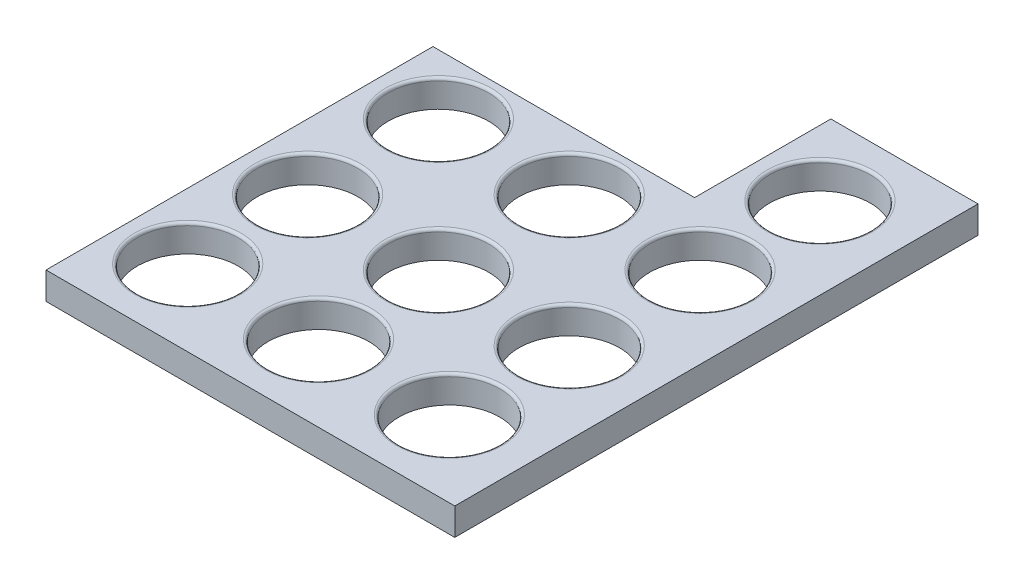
ISO-10303-21;
HEADER;
FILE_DESCRIPTION(('STEP AP214'),'2;1');
FILE_NAME('part.step','',(''),(''),'','','');
FILE_SCHEMA(('AUTOMOTIVE_DESIGN { 1 0 10303 214 1 1 1 1 }'));
ENDSEC;
DATA;
#1=APPLICATION_CONTEXT('core data for automotive mechanical design processes');
#2=APPLICATION_PROTOCOL_DEFINITION('international standard','automotive_design',2000,#1);
#3=PRODUCT_CONTEXT('',#1,'mechanical');
#4=PRODUCT('Part','Part','',(#3));
#5=PRODUCT_RELATED_PRODUCT_CATEGORY('part','',(#4));
#6=PRODUCT_DEFINITION_FORMATION('','',#4);
#7=PRODUCT_DEFINITION_CONTEXT('part definition',#1,'design');
#8=PRODUCT_DEFINITION('design','',#6,#7);
#9=PRODUCT_DEFINITION_SHAPE('','',#8);
#10=(LENGTH_UNIT() NAMED_UNIT(*) SI_UNIT(.MILLI.,.METRE.));
#11=(NAMED_UNIT(*) PLANE_ANGLE_UNIT() SI_UNIT($,.RADIAN.));
#12=(NAMED_UNIT(*) SI_UNIT($,.STERADIAN.) SOLID_ANGLE_UNIT());
#13=UNCERTAINTY_MEASURE_WITH_UNIT(LENGTH_MEASURE(1.E-05),#10,'distance_accuracy_value','');
#14=(GEOMETRIC_REPRESENTATION_CONTEXT(3) GLOBAL_UNCERTAINTY_ASSIGNED_CONTEXT((#13)) GLOBAL_UNIT_ASSIGNED_CONTEXT((#10,
#11,#12)) REPRESENTATION_CONTEXT('',''));
#15=CARTESIAN_POINT('',(0.,0.,0.));
#16=DIRECTION('',(0.,0.,1.));
#17=DIRECTION('',(1.,0.,0.));
#18=AXIS2_PLACEMENT_3D('',#15,#16,#17);
#19=CARTESIAN_POINT('',(63.,5.,0.));
#20=DIRECTION('',(1.,0.,0.));
#21=DIRECTION('',(0.,0.,-1.));
#22=AXIS2_PLACEMENT_3D('',#19,#20,#21);
#23=PLANE('',#22);
#24=DIRECTION('',(0.,0.,1.));
#25=VECTOR('',#24,1.);
#26=CARTESIAN_POINT('',(63.,0.,0.));
#27=LINE('',#26,#25);
#28=CARTESIAN_POINT('',(63.,0.,-48.));
#29=VERTEX_POINT('',#28);
#30=CARTESIAN_POINT('',(63.,0.,48.));
#31=VERTEX_POINT('',#30);
#32=EDGE_CURVE('E106',#29,#31,#27,.T.);
#33=ORIENTED_EDGE('',*,*,#32,.F.);
#34=DIRECTION('',(0.,-1.,0.));
#35=VECTOR('',#34,1.);
#36=CARTESIAN_POINT('',(63.,5.,-48.));
#37=LINE('',#36,#35);
#38=CARTESIAN_POINT('',(63.,5.,-48.));
#39=VERTEX_POINT('',#38);
#40=EDGE_CURVE('E108',#39,#29,#37,.T.);
#41=ORIENTED_EDGE('',*,*,#40,.F.);
#42=DIRECTION('',(0.,0.,1.));
#43=VECTOR('',#42,1.);
#44=CARTESIAN_POINT('',(63.,5.,0.));
#45=LINE('',#44,#43);
#46=CARTESIAN_POINT('',(63.,5.,48.));
#47=VERTEX_POINT('',#46);
#48=EDGE_CURVE('E100',#39,#47,#45,.T.);
#49=ORIENTED_EDGE('',*,*,#48,.T.);
#50=DIRECTION('',(0.,-1.,0.));
#51=VECTOR('',#50,1.);
#52=CARTESIAN_POINT('',(63.,5.,48.));
#53=LINE('',#52,#51);
#54=EDGE_CURVE('E91',#47,#31,#53,.T.);
#55=ORIENTED_EDGE('',*,*,#54,.T.);
#56=EDGE_LOOP('',(#33,#41,#49,#55));
#57=FACE_BOUND('',#56,.T.);
#58=ADVANCED_FACE('F49',(#57),#23,.T.);
#59=CARTESIAN_POINT('',(0.,5.,-48.));
#60=DIRECTION('',(0.,0.,-1.));
#61=DIRECTION('',(-1.,0.,0.));
#62=AXIS2_PLACEMENT_3D('',#59,#60,#61);
#63=PLANE('',#62);
#64=DIRECTION('',(0.,1.,0.));
#65=VECTOR('',#64,1.);
#66=CARTESIAN_POINT('',(36.,-5.,-48.));
#67=LINE('',#66,#65);
#68=CARTESIAN_POINT('',(36.,0.,-48.));
#69=VERTEX_POINT('',#68);
#70=CARTESIAN_POINT('',(36.,5.,-48.));
#71=VERTEX_POINT('',#70);
#72=EDGE_CURVE('E227',#69,#71,#67,.T.);
#73=ORIENTED_EDGE('',*,*,#72,.T.);
#74=DIRECTION('',(1.,0.,0.));
#75=VECTOR('',#74,1.);
#76=CARTESIAN_POINT('',(0.,5.,-48.));
#77=LINE('',#76,#75);
#78=EDGE_CURVE('E242',#71,#39,#77,.T.);
#79=ORIENTED_EDGE('',*,*,#78,.T.);
#80=ORIENTED_EDGE('',*,*,#40,.T.);
#81=DIRECTION('',(1.,0.,0.));
#82=VECTOR('',#81,1.);
#83=CARTESIAN_POINT('',(0.,0.,-48.));
#84=LINE('',#83,#82);
#85=EDGE_CURVE('E101',#69,#29,#84,.T.);
#86=ORIENTED_EDGE('',*,*,#85,.F.);
#87=EDGE_LOOP('',(#73,#79,#80,#86));
#88=FACE_BOUND('',#87,.T.);
#89=ADVANCED_FACE('F296',(#88),#63,.T.);
#90=CARTESIAN_POINT('',(0.,5.,-12.));
#91=DIRECTION('',(0.,-1.,0.));
#92=DIRECTION('',(0.,0.,-1.));
#93=AXIS2_PLACEMENT_3D('',#90,#91,#92);
#94=CYLINDRICAL_SURFACE('',#93,9.25);
#95=CARTESIAN_POINT('',(0.,4.5,-12.));
#96=DIRECTION('',(0.,1.,0.));
#97=DIRECTION('',(0.,0.,1.));
#98=AXIS2_PLACEMENT_3D('',#95,#96,#97);
#99=CIRCLE('',#98,9.25);
#100=CARTESIAN_POINT('',(0.,4.5,-2.75));
#101=VERTEX_POINT('',#100);
#102=EDGE_CURVE('E195',#101,#101,#99,.T.);
#103=ORIENTED_EDGE('',*,*,#102,.T.);
#104=EDGE_LOOP('',(#103));
#105=FACE_BOUND('',#104,.T.);
#106=CARTESIAN_POINT('',(0.,0.,-12.));
#107=DIRECTION('',(0.,1.,0.));
#108=DIRECTION('',(0.,0.,1.));
#109=AXIS2_PLACEMENT_3D('',#106,#107,#108);
#110=CIRCLE('',#109,9.25);
#111=CARTESIAN_POINT('',(0.,0.,-2.75));
#112=VERTEX_POINT('',#111);
#113=EDGE_CURVE('E115',#112,#112,#110,.T.);
#114=ORIENTED_EDGE('',*,*,#113,.F.);
#115=EDGE_LOOP('',(#114));
#116=FACE_BOUND('',#115,.T.);
#117=ADVANCED_FACE('F286',(#105,#116),#94,.F.);
#118=CARTESIAN_POINT('',(0.,5.,12.));
#119=DIRECTION('',(0.,-1.,0.));
#120=DIRECTION('',(0.,0.,-1.));
#121=AXIS2_PLACEMENT_3D('',#118,#119,#120);
#122=CYLINDRICAL_SURFACE('',#121,9.25);
#123=CARTESIAN_POINT('',(0.,4.5,12.));
#124=DIRECTION('',(0.,1.,0.));
#125=DIRECTION('',(0.,0.,1.));
#126=AXIS2_PLACEMENT_3D('',#123,#124,#125);
#127=CIRCLE('',#126,9.25);
#128=CARTESIAN_POINT('',(0.,4.5,21.25));
#129=VERTEX_POINT('',#128);
#130=EDGE_CURVE('E199',#129,#129,#127,.T.);
#131=ORIENTED_EDGE('',*,*,#130,.T.);
#132=EDGE_LOOP('',(#131));
#133=FACE_BOUND('',#132,.T.);
#134=CARTESIAN_POINT('',(0.,0.,12.));
#135=DIRECTION('',(0.,1.,0.));
#136=DIRECTION('',(0.,0.,1.));
#137=AXIS2_PLACEMENT_3D('',#134,#135,#136);
#138=CIRCLE('',#137,9.25);
#139=CARTESIAN_POINT('',(0.,0.,21.25));
#140=VERTEX_POINT('',#139);
#141=EDGE_CURVE('E121',#140,#140,#138,.T.);
#142=ORIENTED_EDGE('',*,*,#141,.F.);
#143=EDGE_LOOP('',(#142));
#144=FACE_BOUND('',#143,.T.);
#145=ADVANCED_FACE('F283',(#133,#144),#122,.F.);
#146=CARTESIAN_POINT('',(0.,5.,34.));
#147=DIRECTION('',(0.,-1.,0.));
#148=DIRECTION('',(0.,0.,-1.));
#149=AXIS2_PLACEMENT_3D('',#146,#147,#148);
#150=CYLINDRICAL_SURFACE('',#149,9.25);
#151=CARTESIAN_POINT('',(0.,4.5,34.));
#152=DIRECTION('',(0.,1.,0.));
#153=DIRECTION('',(0.,0.,1.));
#154=AXIS2_PLACEMENT_3D('',#151,#152,#153);
#155=CIRCLE('',#154,9.25);
#156=CARTESIAN_POINT('',(0.,4.5,43.25));
#157=VERTEX_POINT('',#156);
#158=EDGE_CURVE('E203',#157,#157,#155,.T.);
#159=ORIENTED_EDGE('',*,*,#158,.T.);
#160=EDGE_LOOP('',(#159));
#161=FACE_BOUND('',#160,.T.);
#162=CARTESIAN_POINT('',(0.,0.,34.));
#163=DIRECTION('',(0.,1.,0.));
#164=DIRECTION('',(0.,0.,1.));
#165=AXIS2_PLACEMENT_3D('',#162,#163,#164);
#166=CIRCLE('',#165,9.25);
#167=CARTESIAN_POINT('',(0.,0.,43.25));
#168=VERTEX_POINT('',#167);
#169=EDGE_CURVE('E274',#168,#168,#166,.T.);
#170=ORIENTED_EDGE('',*,*,#169,.F.);
#171=EDGE_LOOP('',(#170));
#172=FACE_BOUND('',#171,.T.);
#173=ADVANCED_FACE('F285',(#161,#172),#150,.F.);
#174=CARTESIAN_POINT('',(24.,5.,34.));
#175=DIRECTION('',(0.,-1.,0.));
#176=DIRECTION('',(0.,0.,-1.));
#177=AXIS2_PLACEMENT_3D('',#174,#175,#176);
#178=CYLINDRICAL_SURFACE('',#177,9.25);
#179=CARTESIAN_POINT('',(24.,4.5,34.));
#180=DIRECTION('',(0.,1.,0.));
#181=DIRECTION('',(0.,0.,1.));
#182=AXIS2_PLACEMENT_3D('',#179,#180,#181);
#183=CIRCLE('',#182,9.25);
#184=CARTESIAN_POINT('',(24.,4.5,43.25));
#185=VERTEX_POINT('',#184);
#186=EDGE_CURVE('E171',#185,#185,#183,.T.);
#187=ORIENTED_EDGE('',*,*,#186,.T.);
#188=EDGE_LOOP('',(#187));
#189=FACE_BOUND('',#188,.T.);
#190=CARTESIAN_POINT('',(24.,0.,34.));
#191=DIRECTION('',(0.,1.,0.));
#192=DIRECTION('',(0.,0.,1.));
#193=AXIS2_PLACEMENT_3D('',#190,#191,#192);
#194=CIRCLE('',#193,9.25);
#195=CARTESIAN_POINT('',(24.,0.,43.25));
#196=VERTEX_POINT('',#195);
#197=EDGE_CURVE('E270',#196,#196,#194,.T.);
#198=ORIENTED_EDGE('',*,*,#197,.F.);
#199=EDGE_LOOP('',(#198));
#200=FACE_BOUND('',#199,.T.);
#201=ADVANCED_FACE('F293',(#189,#200),#178,.F.);
#202=CARTESIAN_POINT('',(24.,5.,12.));
#203=DIRECTION('',(0.,-1.,0.));
#204=DIRECTION('',(0.,0.,-1.));
#205=AXIS2_PLACEMENT_3D('',#202,#203,#204);
#206=CYLINDRICAL_SURFACE('',#205,9.25);
#207=CARTESIAN_POINT('',(24.,4.5,12.));
#208=DIRECTION('',(0.,1.,0.));
#209=DIRECTION('',(0.,0.,1.));
#210=AXIS2_PLACEMENT_3D('',#207,#208,#209);
#211=CIRCLE('',#210,9.25);
#212=CARTESIAN_POINT('',(24.,4.5,21.25));
#213=VERTEX_POINT('',#212);
#214=EDGE_CURVE('E175',#213,#213,#211,.T.);
#215=ORIENTED_EDGE('',*,*,#214,.T.);
#216=EDGE_LOOP('',(#215));
#217=FACE_BOUND('',#216,.T.);
#218=CARTESIAN_POINT('',(24.,0.,12.));
#219=DIRECTION('',(0.,1.,0.));
#220=DIRECTION('',(0.,0.,1.));
#221=AXIS2_PLACEMENT_3D('',#218,#219,#220);
#222=CIRCLE('',#221,9.25);
#223=CARTESIAN_POINT('',(24.,0.,21.25));
#224=VERTEX_POINT('',#223);
#225=EDGE_CURVE('E266',#224,#224,#222,.T.);
#226=ORIENTED_EDGE('',*,*,#225,.F.);
#227=EDGE_LOOP('',(#226));
#228=FACE_BOUND('',#227,.T.);
#229=ADVANCED_FACE('F394',(#217,#228),#206,.F.);
#230=CARTESIAN_POINT('',(24.,5.,-12.));
#231=DIRECTION('',(0.,-1.,0.));
#232=DIRECTION('',(0.,0.,-1.));
#233=AXIS2_PLACEMENT_3D('',#230,#231,#232);
#234=CYLINDRICAL_SURFACE('',#233,9.25);
#235=CARTESIAN_POINT('',(24.,4.5,-12.));
#236=DIRECTION('',(0.,1.,0.));
#237=DIRECTION('',(0.,0.,1.));
#238=AXIS2_PLACEMENT_3D('',#235,#236,#237);
#239=CIRCLE('',#238,9.25);
#240=CARTESIAN_POINT('',(24.,4.5,-2.75));
#241=VERTEX_POINT('',#240);
#242=EDGE_CURVE('E183',#241,#241,#239,.T.);
#243=ORIENTED_EDGE('',*,*,#242,.T.);
#244=EDGE_LOOP('',(#243));
#245=FACE_BOUND('',#244,.T.);
#246=CARTESIAN_POINT('',(24.,0.,-12.));
#247=DIRECTION('',(0.,1.,0.));
#248=DIRECTION('',(0.,0.,1.));
#249=AXIS2_PLACEMENT_3D('',#246,#247,#248);
#250=CIRCLE('',#249,9.25);
#251=CARTESIAN_POINT('',(24.,0.,-2.75));
#252=VERTEX_POINT('',#251);
#253=EDGE_CURVE('E262',#252,#252,#250,.T.);
#254=ORIENTED_EDGE('',*,*,#253,.F.);
#255=EDGE_LOOP('',(#254));
#256=FACE_BOUND('',#255,.T.);
#257=ADVANCED_FACE('F390',(#245,#256),#234,.F.);
#258=CARTESIAN_POINT('',(48.,5.,34.));
#259=DIRECTION('',(0.,-1.,0.));
#260=DIRECTION('',(0.,0.,-1.));
#261=AXIS2_PLACEMENT_3D('',#258,#259,#260);
#262=CYLINDRICAL_SURFACE('',#261,9.25);
#263=CARTESIAN_POINT('',(48.,4.5,34.));
#264=DIRECTION('',(0.,1.,0.));
#265=DIRECTION('',(0.,0.,1.));
#266=AXIS2_PLACEMENT_3D('',#263,#264,#265);
#267=CIRCLE('',#266,9.25);
#268=CARTESIAN_POINT('',(48.,4.5,43.25));
#269=VERTEX_POINT('',#268);
#270=EDGE_CURVE('E127',#269,#269,#267,.T.);
#271=ORIENTED_EDGE('',*,*,#270,.T.);
#272=EDGE_LOOP('',(#271));
#273=FACE_BOUND('',#272,.T.);
#274=CARTESIAN_POINT('',(48.,0.,34.));
#275=DIRECTION('',(0.,1.,0.));
#276=DIRECTION('',(0.,0.,1.));
#277=AXIS2_PLACEMENT_3D('',#274,#275,#276);
#278=CIRCLE('',#277,9.25);
#279=CARTESIAN_POINT('',(48.,0.,43.25));
#280=VERTEX_POINT('',#279);
#281=EDGE_CURVE('E258',#280,#280,#278,.T.);
#282=ORIENTED_EDGE('',*,*,#281,.F.);
#283=EDGE_LOOP('',(#282));
#284=FACE_BOUND('',#283,.T.);
#285=ADVANCED_FACE('F386',(#273,#284),#262,.F.);
#286=CARTESIAN_POINT('',(48.,5.,12.));
#287=DIRECTION('',(0.,-1.,0.));
#288=DIRECTION('',(0.,0.,-1.));
#289=AXIS2_PLACEMENT_3D('',#286,#287,#288);
#290=CYLINDRICAL_SURFACE('',#289,9.25);
#291=CARTESIAN_POINT('',(48.,4.5,12.));
#292=DIRECTION('',(0.,1.,0.));
#293=DIRECTION('',(0.,0.,1.));
#294=AXIS2_PLACEMENT_3D('',#291,#292,#293);
#295=CIRCLE('',#294,9.25);
#296=CARTESIAN_POINT('',(48.,4.5,21.25));
#297=VERTEX_POINT('',#296);
#298=EDGE_CURVE('E179',#297,#297,#295,.T.);
#299=ORIENTED_EDGE('',*,*,#298,.T.);
#300=EDGE_LOOP('',(#299));
#301=FACE_BOUND('',#300,.T.);
#302=CARTESIAN_POINT('',(48.,0.,12.));
#303=DIRECTION('',(0.,1.,0.));
#304=DIRECTION('',(0.,0.,1.));
#305=AXIS2_PLACEMENT_3D('',#302,#303,#304);
#306=CIRCLE('',#305,9.25);
#307=CARTESIAN_POINT('',(48.,0.,21.25));
#308=VERTEX_POINT('',#307);
#309=EDGE_CURVE('E254',#308,#308,#306,.T.);
#310=ORIENTED_EDGE('',*,*,#309,.F.);
#311=EDGE_LOOP('',(#310));
#312=FACE_BOUND('',#311,.T.);
#313=ADVANCED_FACE('F382',(#301,#312),#290,.F.);
#314=CARTESIAN_POINT('',(48.,5.,-12.));
#315=DIRECTION('',(0.,-1.,0.));
#316=DIRECTION('',(0.,0.,-1.));
#317=AXIS2_PLACEMENT_3D('',#314,#315,#316);
#318=CYLINDRICAL_SURFACE('',#317,9.25);
#319=CARTESIAN_POINT('',(48.,4.5,-12.));
#320=DIRECTION('',(0.,1.,0.));
#321=DIRECTION('',(0.,0.,1.));
#322=AXIS2_PLACEMENT_3D('',#319,#320,#321);
#323=CIRCLE('',#322,9.25);
#324=CARTESIAN_POINT('',(48.,4.5,-2.75));
#325=VERTEX_POINT('',#324);
#326=EDGE_CURVE('E187',#325,#325,#323,.T.);
#327=ORIENTED_EDGE('',*,*,#326,.T.);
#328=EDGE_LOOP('',(#327));
#329=FACE_BOUND('',#328,.T.);
#330=CARTESIAN_POINT('',(48.,0.,-12.));
#331=DIRECTION('',(0.,1.,0.));
#332=DIRECTION('',(0.,0.,1.));
#333=AXIS2_PLACEMENT_3D('',#330,#331,#332);
#334=CIRCLE('',#333,9.25);
#335=CARTESIAN_POINT('',(48.,0.,-2.75));
#336=VERTEX_POINT('',#335);
#337=EDGE_CURVE('E250',#336,#336,#334,.T.);
#338=ORIENTED_EDGE('',*,*,#337,.F.);
#339=EDGE_LOOP('',(#338));
#340=FACE_BOUND('',#339,.T.);
#341=ADVANCED_FACE('F378',(#329,#340),#318,.F.);
#342=CARTESIAN_POINT('',(48.,5.,-34.));
#343=DIRECTION('',(0.,-1.,0.));
#344=DIRECTION('',(0.,0.,-1.));
#345=AXIS2_PLACEMENT_3D('',#342,#343,#344);
#346=CYLINDRICAL_SURFACE('',#345,9.25);
#347=CARTESIAN_POINT('',(48.,4.5,-34.));
#348=DIRECTION('',(0.,1.,0.));
#349=DIRECTION('',(0.,0.,1.));
#350=AXIS2_PLACEMENT_3D('',#347,#348,#349);
#351=CIRCLE('',#350,9.25);
#352=CARTESIAN_POINT('',(48.,4.5,-24.75));
#353=VERTEX_POINT('',#352);
#354=EDGE_CURVE('E191',#353,#353,#351,.T.);
#355=ORIENTED_EDGE('',*,*,#354,.T.);
#356=EDGE_LOOP('',(#355));
#357=FACE_BOUND('',#356,.T.);
#358=CARTESIAN_POINT('',(48.,0.,-34.));
#359=DIRECTION('',(0.,1.,0.));
#360=DIRECTION('',(0.,0.,1.));
#361=AXIS2_PLACEMENT_3D('',#358,#359,#360);
#362=CIRCLE('',#361,9.25);
#363=CARTESIAN_POINT('',(48.,0.,-24.75));
#364=VERTEX_POINT('',#363);
#365=EDGE_CURVE('E232',#364,#364,#362,.T.);
#366=ORIENTED_EDGE('',*,*,#365,.F.);
#367=EDGE_LOOP('',(#366));
#368=FACE_BOUND('',#367,.T.);
#369=ADVANCED_FACE('F310',(#357,#368),#346,.F.);
#370=CARTESIAN_POINT('',(0.,5.,48.));
#371=DIRECTION('',(0.,0.,-1.));
#372=DIRECTION('',(-1.,0.,0.));
#373=AXIS2_PLACEMENT_3D('',#370,#371,#372);
#374=PLANE('',#373);
#375=DIRECTION('',(1.,0.,0.));
#376=VECTOR('',#375,1.);
#377=CARTESIAN_POINT('',(0.,5.,48.));
#378=LINE('',#377,#376);
#379=CARTESIAN_POINT('',(-12.,5.,48.));
#380=VERTEX_POINT('',#379);
#381=EDGE_CURVE('E74',#380,#47,#378,.T.);
#382=ORIENTED_EDGE('',*,*,#381,.F.);
#383=DIRECTION('',(0.,1.,0.));
#384=VECTOR('',#383,1.);
#385=CARTESIAN_POINT('',(-12.,-5.,48.));
#386=LINE('',#385,#384);
#387=CARTESIAN_POINT('',(-12.,0.,48.));
#388=VERTEX_POINT('',#387);
#389=EDGE_CURVE('E95',#388,#380,#386,.T.);
#390=ORIENTED_EDGE('',*,*,#389,.F.);
#391=DIRECTION('',(1.,0.,0.));
#392=VECTOR('',#391,1.);
#393=CARTESIAN_POINT('',(0.,0.,48.));
#394=LINE('',#393,#392);
#395=EDGE_CURVE('E88',#388,#31,#394,.T.);
#396=ORIENTED_EDGE('',*,*,#395,.T.);
#397=ORIENTED_EDGE('',*,*,#54,.F.);
#398=EDGE_LOOP('',(#382,#390,#396,#397));
#399=FACE_BOUND('',#398,.T.);
#400=ADVANCED_FACE('F90',(#399),#374,.F.);
#401=CARTESIAN_POINT('',(0.,5.,0.));
#402=DIRECTION('',(0.,1.,0.));
#403=DIRECTION('',(0.,0.,1.));
#404=AXIS2_PLACEMENT_3D('',#401,#402,#403);
#405=PLANE('',#404);
#406=DIRECTION('',(0.,0.,-1.));
#407=VECTOR('',#406,1.);
#408=CARTESIAN_POINT('',(36.,5.,-48.));
#409=LINE('',#408,#407);
#410=CARTESIAN_POINT('',(36.,5.,-23.));
#411=VERTEX_POINT('',#410);
#412=EDGE_CURVE('E239',#411,#71,#409,.T.);
#413=ORIENTED_EDGE('',*,*,#412,.F.);
#414=DIRECTION('',(1.,0.,0.));
#415=VECTOR('',#414,1.);
#416=CARTESIAN_POINT('',(36.,5.,-23.));
#417=LINE('',#416,#415);
#418=CARTESIAN_POINT('',(-12.,5.,-23.));
#419=VERTEX_POINT('',#418);
#420=EDGE_CURVE('E222',#419,#411,#417,.T.);
#421=ORIENTED_EDGE('',*,*,#420,.F.);
#422=DIRECTION('',(0.,0.,-1.));
#423=VECTOR('',#422,1.);
#424=CARTESIAN_POINT('',(-12.,5.,-23.));
#425=LINE('',#424,#423);
#426=EDGE_CURVE('E643',#380,#419,#425,.T.);
#427=ORIENTED_EDGE('',*,*,#426,.F.);
#428=ORIENTED_EDGE('',*,*,#381,.T.);
#429=ORIENTED_EDGE('',*,*,#48,.F.);
#430=ORIENTED_EDGE('',*,*,#78,.F.);
#431=EDGE_LOOP('',(#413,#421,#427,#428,#429,#430));
#432=FACE_BOUND('',#431,.T.);
#433=CARTESIAN_POINT('',(48.,5.,34.));
#434=DIRECTION('',(0.,1.,0.));
#435=DIRECTION('',(0.,0.,1.));
#436=AXIS2_PLACEMENT_3D('',#433,#434,#435);
#437=CIRCLE('',#436,9.75);
#438=CARTESIAN_POINT('',(48.,5.,43.75));
#439=VERTEX_POINT('',#438);
#440=EDGE_CURVE('E167',#439,#439,#437,.F.);
#441=ORIENTED_EDGE('',*,*,#440,.T.);
#442=EDGE_LOOP('',(#441));
#443=FACE_BOUND('',#442,.T.);
#444=CARTESIAN_POINT('',(24.,5.,34.));
#445=DIRECTION('',(0.,1.,0.));
#446=DIRECTION('',(0.,0.,1.));
#447=AXIS2_PLACEMENT_3D('',#444,#445,#446);
#448=CIRCLE('',#447,9.75);
#449=CARTESIAN_POINT('',(24.,5.,43.75));
#450=VERTEX_POINT('',#449);
#451=EDGE_CURVE('E163',#450,#450,#448,.F.);
#452=ORIENTED_EDGE('',*,*,#451,.T.);
#453=EDGE_LOOP('',(#452));
#454=FACE_BOUND('',#453,.T.);
#455=CARTESIAN_POINT('',(24.,5.,12.));
#456=DIRECTION('',(0.,1.,0.));
#457=DIRECTION('',(0.,0.,1.));
#458=AXIS2_PLACEMENT_3D('',#455,#456,#457);
#459=CIRCLE('',#458,9.75);
#460=CARTESIAN_POINT('',(24.,5.,21.75));
#461=VERTEX_POINT('',#460);
#462=EDGE_CURVE('E159',#461,#461,#459,.F.);
#463=ORIENTED_EDGE('',*,*,#462,.T.);
#464=EDGE_LOOP('',(#463));
#465=FACE_BOUND('',#464,.T.);
#466=CARTESIAN_POINT('',(48.,5.,12.));
#467=DIRECTION('',(0.,1.,0.));
#468=DIRECTION('',(0.,0.,1.));
#469=AXIS2_PLACEMENT_3D('',#466,#467,#468);
#470=CIRCLE('',#469,9.75);
#471=CARTESIAN_POINT('',(48.,5.,21.75));
#472=VERTEX_POINT('',#471);
#473=EDGE_CURVE('E155',#472,#472,#470,.F.);
#474=ORIENTED_EDGE('',*,*,#473,.T.);
#475=EDGE_LOOP('',(#474));
#476=FACE_BOUND('',#475,.T.);
#477=CARTESIAN_POINT('',(24.,5.,-12.));
#478=DIRECTION('',(0.,1.,0.));
#479=DIRECTION('',(0.,0.,1.));
#480=AXIS2_PLACEMENT_3D('',#477,#478,#479);
#481=CIRCLE('',#480,9.75);
#482=CARTESIAN_POINT('',(24.,5.,-2.25));
#483=VERTEX_POINT('',#482);
#484=EDGE_CURVE('E151',#483,#483,#481,.F.);
#485=ORIENTED_EDGE('',*,*,#484,.T.);
#486=EDGE_LOOP('',(#485));
#487=FACE_BOUND('',#486,.T.);
#488=CARTESIAN_POINT('',(48.,5.,-12.));
#489=DIRECTION('',(0.,1.,0.));
#490=DIRECTION('',(0.,0.,1.));
#491=AXIS2_PLACEMENT_3D('',#488,#489,#490);
#492=CIRCLE('',#491,9.75);
#493=CARTESIAN_POINT('',(48.,5.,-2.25));
#494=VERTEX_POINT('',#493);
#495=EDGE_CURVE('E147',#494,#494,#492,.F.);
#496=ORIENTED_EDGE('',*,*,#495,.T.);
#497=EDGE_LOOP('',(#496));
#498=FACE_BOUND('',#497,.T.);
#499=CARTESIAN_POINT('',(48.,5.,-34.));
#500=DIRECTION('',(0.,1.,0.));
#501=DIRECTION('',(0.,0.,1.));
#502=AXIS2_PLACEMENT_3D('',#499,#500,#501);
#503=CIRCLE('',#502,9.75);
#504=CARTESIAN_POINT('',(48.,5.,-24.25));
#505=VERTEX_POINT('',#504);
#506=EDGE_CURVE('E143',#505,#505,#503,.F.);
#507=ORIENTED_EDGE('',*,*,#506,.T.);
#508=EDGE_LOOP('',(#507));
#509=FACE_BOUND('',#508,.T.);
#510=CARTESIAN_POINT('',(0.,5.,-12.));
#511=DIRECTION('',(0.,1.,0.));
#512=DIRECTION('',(0.,0.,1.));
#513=AXIS2_PLACEMENT_3D('',#510,#511,#512);
#514=CIRCLE('',#513,9.75);
#515=CARTESIAN_POINT('',(0.,5.,-2.25));
#516=VERTEX_POINT('',#515);
#517=EDGE_CURVE('E139',#516,#516,#514,.F.);
#518=ORIENTED_EDGE('',*,*,#517,.T.);
#519=EDGE_LOOP('',(#518));
#520=FACE_BOUND('',#519,.T.);
#521=CARTESIAN_POINT('',(0.,5.,12.));
#522=DIRECTION('',(0.,1.,0.));
#523=DIRECTION('',(0.,0.,1.));
#524=AXIS2_PLACEMENT_3D('',#521,#522,#523);
#525=CIRCLE('',#524,9.75);
#526=CARTESIAN_POINT('',(0.,5.,21.75));
#527=VERTEX_POINT('',#526);
#528=EDGE_CURVE('E135',#527,#527,#525,.F.);
#529=ORIENTED_EDGE('',*,*,#528,.T.);
#530=EDGE_LOOP('',(#529));
#531=FACE_BOUND('',#530,.T.);
#532=CARTESIAN_POINT('',(0.,5.,34.));
#533=DIRECTION('',(0.,1.,0.));
#534=DIRECTION('',(0.,0.,1.));
#535=AXIS2_PLACEMENT_3D('',#532,#533,#534);
#536=CIRCLE('',#535,9.75);
#537=CARTESIAN_POINT('',(0.,5.,43.75));
#538=VERTEX_POINT('',#537);
#539=EDGE_CURVE('E131',#538,#538,#536,.F.);
#540=ORIENTED_EDGE('',*,*,#539,.T.);
#541=EDGE_LOOP('',(#540));
#542=FACE_BOUND('',#541,.T.);
#543=ADVANCED_FACE('F309',(#432,#443,#454,#465,#476,#487,#498,#509,#520,#531,#542),#405,.T.);
#544=CARTESIAN_POINT('',(0.,0.,0.));
#545=DIRECTION('',(0.,1.,0.));
#546=DIRECTION('',(0.,0.,1.));
#547=AXIS2_PLACEMENT_3D('',#544,#545,#546);
#548=PLANE('',#547);
#549=ORIENTED_EDGE('',*,*,#365,.T.);
#550=EDGE_LOOP('',(#549));
#551=FACE_BOUND('',#550,.T.);
#552=ORIENTED_EDGE('',*,*,#337,.T.);
#553=EDGE_LOOP('',(#552));
#554=FACE_BOUND('',#553,.T.);
#555=ORIENTED_EDGE('',*,*,#309,.T.);
#556=EDGE_LOOP('',(#555));
#557=FACE_BOUND('',#556,.T.);
#558=ORIENTED_EDGE('',*,*,#281,.T.);
#559=EDGE_LOOP('',(#558));
#560=FACE_BOUND('',#559,.T.);
#561=ORIENTED_EDGE('',*,*,#253,.T.);
#562=EDGE_LOOP('',(#561));
#563=FACE_BOUND('',#562,.T.);
#564=ORIENTED_EDGE('',*,*,#225,.T.);
#565=EDGE_LOOP('',(#564));
#566=FACE_BOUND('',#565,.T.);
#567=ORIENTED_EDGE('',*,*,#197,.T.);
#568=EDGE_LOOP('',(#567));
#569=FACE_BOUND('',#568,.T.);
#570=ORIENTED_EDGE('',*,*,#169,.T.);
#571=EDGE_LOOP('',(#570));
#572=FACE_BOUND('',#571,.T.);
#573=ORIENTED_EDGE('',*,*,#141,.T.);
#574=EDGE_LOOP('',(#573));
#575=FACE_BOUND('',#574,.T.);
#576=ORIENTED_EDGE('',*,*,#113,.T.);
#577=EDGE_LOOP('',(#576));
#578=FACE_BOUND('',#577,.T.);
#579=DIRECTION('',(1.,0.,0.));
#580=VECTOR('',#579,1.);
#581=CARTESIAN_POINT('',(0.,0.,-23.));
#582=LINE('',#581,#580);
#583=CARTESIAN_POINT('',(-12.,0.,-23.));
#584=VERTEX_POINT('',#583);
#585=CARTESIAN_POINT('',(36.,0.,-23.));
#586=VERTEX_POINT('',#585);
#587=EDGE_CURVE('E58',#584,#586,#582,.T.);
#588=ORIENTED_EDGE('',*,*,#587,.T.);
#589=DIRECTION('',(0.,0.,-1.));
#590=VECTOR('',#589,1.);
#591=CARTESIAN_POINT('',(36.,0.,0.));
#592=LINE('',#591,#590);
#593=EDGE_CURVE('E11',#586,#69,#592,.T.);
#594=ORIENTED_EDGE('',*,*,#593,.T.);
#595=ORIENTED_EDGE('',*,*,#85,.T.);
#596=ORIENTED_EDGE('',*,*,#32,.T.);
#597=ORIENTED_EDGE('',*,*,#395,.F.);
#598=DIRECTION('',(0.,0.,-1.));
#599=VECTOR('',#598,1.);
#600=CARTESIAN_POINT('',(-12.,0.,0.));
#601=LINE('',#600,#599);
#602=EDGE_CURVE('E207',#388,#584,#601,.T.);
#603=ORIENTED_EDGE('',*,*,#602,.T.);
#604=EDGE_LOOP('',(#588,#594,#595,#596,#597,#603));
#605=FACE_BOUND('',#604,.T.);
#606=ADVANCED_FACE('F111',(#551,#554,#557,#560,#563,#566,#569,#572,#575,#578,#605),#548,.F.);
#607=CARTESIAN_POINT('',(48.,4.5,34.));
#608=DIRECTION('',(0.,1.,0.));
#609=DIRECTION('',(0.,0.,1.));
#610=AXIS2_PLACEMENT_3D('',#607,#608,#609);
#611=TOROIDAL_SURFACE('',#610,9.75,0.5);
#612=ORIENTED_EDGE('',*,*,#440,.F.);
#613=EDGE_LOOP('',(#612));
#614=FACE_BOUND('',#613,.T.);
#615=ORIENTED_EDGE('',*,*,#270,.F.);
#616=EDGE_LOOP('',(#615));
#617=FACE_BOUND('',#616,.T.);
#618=ADVANCED_FACE('F313',(#614,#617),#611,.T.);
#619=CARTESIAN_POINT('',(24.,4.5,34.));
#620=DIRECTION('',(0.,1.,0.));
#621=DIRECTION('',(0.,0.,1.));
#622=AXIS2_PLACEMENT_3D('',#619,#620,#621);
#623=TOROIDAL_SURFACE('',#622,9.75,0.5);
#624=ORIENTED_EDGE('',*,*,#451,.F.);
#625=EDGE_LOOP('',(#624));
#626=FACE_BOUND('',#625,.T.);
#627=ORIENTED_EDGE('',*,*,#186,.F.);
#628=EDGE_LOOP('',(#627));
#629=FACE_BOUND('',#628,.T.);
#630=ADVANCED_FACE('F368',(#626,#629),#623,.T.);
#631=CARTESIAN_POINT('',(24.,4.5,12.));
#632=DIRECTION('',(0.,1.,0.));
#633=DIRECTION('',(0.,0.,1.));
#634=AXIS2_PLACEMENT_3D('',#631,#632,#633);
#635=TOROIDAL_SURFACE('',#634,9.75,0.5);
#636=ORIENTED_EDGE('',*,*,#462,.F.);
#637=EDGE_LOOP('',(#636));
#638=FACE_BOUND('',#637,.T.);
#639=ORIENTED_EDGE('',*,*,#214,.F.);
#640=EDGE_LOOP('',(#639));
#641=FACE_BOUND('',#640,.T.);
#642=ADVANCED_FACE('F364',(#638,#641),#635,.T.);
#643=CARTESIAN_POINT('',(48.,4.5,12.));
#644=DIRECTION('',(0.,1.,0.));
#645=DIRECTION('',(0.,0.,1.));
#646=AXIS2_PLACEMENT_3D('',#643,#644,#645);
#647=TOROIDAL_SURFACE('',#646,9.75,0.5);
#648=ORIENTED_EDGE('',*,*,#473,.F.);
#649=EDGE_LOOP('',(#648));
#650=FACE_BOUND('',#649,.T.);
#651=ORIENTED_EDGE('',*,*,#298,.F.);
#652=EDGE_LOOP('',(#651));
#653=FACE_BOUND('',#652,.T.);
#654=ADVANCED_FACE('F360',(#650,#653),#647,.T.);
#655=CARTESIAN_POINT('',(24.,4.5,-12.));
#656=DIRECTION('',(0.,1.,0.));
#657=DIRECTION('',(0.,0.,1.));
#658=AXIS2_PLACEMENT_3D('',#655,#656,#657);
#659=TOROIDAL_SURFACE('',#658,9.75,0.5);
#660=ORIENTED_EDGE('',*,*,#484,.F.);
#661=EDGE_LOOP('',(#660));
#662=FACE_BOUND('',#661,.T.);
#663=ORIENTED_EDGE('',*,*,#242,.F.);
#664=EDGE_LOOP('',(#663));
#665=FACE_BOUND('',#664,.T.);
#666=ADVANCED_FACE('F356',(#662,#665),#659,.T.);
#667=CARTESIAN_POINT('',(48.,4.5,-12.));
#668=DIRECTION('',(0.,1.,0.));
#669=DIRECTION('',(0.,0.,1.));
#670=AXIS2_PLACEMENT_3D('',#667,#668,#669);
#671=TOROIDAL_SURFACE('',#670,9.75,0.5);
#672=ORIENTED_EDGE('',*,*,#495,.F.);
#673=EDGE_LOOP('',(#672));
#674=FACE_BOUND('',#673,.T.);
#675=ORIENTED_EDGE('',*,*,#326,.F.);
#676=EDGE_LOOP('',(#675));
#677=FACE_BOUND('',#676,.T.);
#678=ADVANCED_FACE('F352',(#674,#677),#671,.T.);
#679=CARTESIAN_POINT('',(48.,4.5,-34.));
#680=DIRECTION('',(0.,1.,0.));
#681=DIRECTION('',(0.,0.,1.));
#682=AXIS2_PLACEMENT_3D('',#679,#680,#681);
#683=TOROIDAL_SURFACE('',#682,9.75,0.5);
#684=ORIENTED_EDGE('',*,*,#506,.F.);
#685=EDGE_LOOP('',(#684));
#686=FACE_BOUND('',#685,.T.);
#687=ORIENTED_EDGE('',*,*,#354,.F.);
#688=EDGE_LOOP('',(#687));
#689=FACE_BOUND('',#688,.T.);
#690=ADVANCED_FACE('F344',(#686,#689),#683,.T.);
#691=CARTESIAN_POINT('',(0.,4.5,-12.));
#692=DIRECTION('',(0.,1.,0.));
#693=DIRECTION('',(0.,0.,1.));
#694=AXIS2_PLACEMENT_3D('',#691,#692,#693);
#695=TOROIDAL_SURFACE('',#694,9.75,0.5);
#696=ORIENTED_EDGE('',*,*,#517,.F.);
#697=EDGE_LOOP('',(#696));
#698=FACE_BOUND('',#697,.T.);
#699=ORIENTED_EDGE('',*,*,#102,.F.);
#700=EDGE_LOOP('',(#699));
#701=FACE_BOUND('',#700,.T.);
#702=ADVANCED_FACE('F332',(#698,#701),#695,.T.);
#703=CARTESIAN_POINT('',(0.,4.5,12.));
#704=DIRECTION('',(0.,1.,0.));
#705=DIRECTION('',(0.,0.,1.));
#706=AXIS2_PLACEMENT_3D('',#703,#704,#705);
#707=TOROIDAL_SURFACE('',#706,9.75,0.5);
#708=ORIENTED_EDGE('',*,*,#528,.F.);
#709=EDGE_LOOP('',(#708));
#710=FACE_BOUND('',#709,.T.);
#711=ORIENTED_EDGE('',*,*,#130,.F.);
#712=EDGE_LOOP('',(#711));
#713=FACE_BOUND('',#712,.T.);
#714=ADVANCED_FACE('F327',(#710,#713),#707,.T.);
#715=CARTESIAN_POINT('',(0.,4.5,34.));
#716=DIRECTION('',(0.,1.,0.));
#717=DIRECTION('',(0.,0.,1.));
#718=AXIS2_PLACEMENT_3D('',#715,#716,#717);
#719=TOROIDAL_SURFACE('',#718,9.75,0.5);
#720=ORIENTED_EDGE('',*,*,#539,.F.);
#721=EDGE_LOOP('',(#720));
#722=FACE_BOUND('',#721,.T.);
#723=ORIENTED_EDGE('',*,*,#158,.F.);
#724=EDGE_LOOP('',(#723));
#725=FACE_BOUND('',#724,.T.);
#726=ADVANCED_FACE('F51',(#722,#725),#719,.T.);
#727=CARTESIAN_POINT('',(36.,-5.,-48.));
#728=DIRECTION('',(1.,0.,0.));
#729=DIRECTION('',(0.,0.,-1.));
#730=AXIS2_PLACEMENT_3D('',#727,#728,#729);
#731=PLANE('',#730);
#732=DIRECTION('',(0.,1.,0.));
#733=VECTOR('',#732,1.);
#734=CARTESIAN_POINT('',(36.,-5.,-23.));
#735=LINE('',#734,#733);
#736=EDGE_CURVE('E219',#586,#411,#735,.T.);
#737=ORIENTED_EDGE('',*,*,#736,.T.);
#738=ORIENTED_EDGE('',*,*,#412,.T.);
#739=ORIENTED_EDGE('',*,*,#72,.F.);
#740=ORIENTED_EDGE('',*,*,#593,.F.);
#741=EDGE_LOOP('',(#737,#738,#739,#740));
#742=FACE_BOUND('',#741,.T.);
#743=ADVANCED_FACE('F322',(#742),#731,.F.);
#744=CARTESIAN_POINT('',(36.,-5.,-23.));
#745=DIRECTION('',(0.,0.,1.));
#746=DIRECTION('',(1.,0.,0.));
#747=AXIS2_PLACEMENT_3D('',#744,#745,#746);
#748=PLANE('',#747);
#749=DIRECTION('',(0.,1.,0.));
#750=VECTOR('',#749,1.);
#751=CARTESIAN_POINT('',(-12.,-5.,-23.));
#752=LINE('',#751,#750);
#753=EDGE_CURVE('E65',#584,#419,#752,.T.);
#754=ORIENTED_EDGE('',*,*,#753,.T.);
#755=ORIENTED_EDGE('',*,*,#420,.T.);
#756=ORIENTED_EDGE('',*,*,#736,.F.);
#757=ORIENTED_EDGE('',*,*,#587,.F.);
#758=EDGE_LOOP('',(#754,#755,#756,#757));
#759=FACE_BOUND('',#758,.T.);
#760=ADVANCED_FACE('F215',(#759),#748,.F.);
#761=CARTESIAN_POINT('',(-12.,-5.,-23.));
#762=DIRECTION('',(1.,0.,0.));
#763=DIRECTION('',(0.,0.,-1.));
#764=AXIS2_PLACEMENT_3D('',#761,#762,#763);
#765=PLANE('',#764);
#766=ORIENTED_EDGE('',*,*,#389,.T.);
#767=ORIENTED_EDGE('',*,*,#426,.T.);
#768=ORIENTED_EDGE('',*,*,#753,.F.);
#769=ORIENTED_EDGE('',*,*,#602,.F.);
#770=EDGE_LOOP('',(#766,#767,#768,#769));
#771=FACE_BOUND('',#770,.T.);
#772=ADVANCED_FACE('F317',(#771),#765,.F.);
#773=CLOSED_SHELL('',(#58,#89,#117,#145,#173,#201,#229,#257,#285,#313,#341,#369,#400,#543,#606,
#618,#630,#642,#654,#666,#678,#690,#702,#714,#726,#743,#760,#772));
#774=MANIFOLD_SOLID_BREP('B2',#773);
#775=ADVANCED_BREP_SHAPE_REPRESENTATION('',(#18,#774),#14);
#776=SHAPE_DEFINITION_REPRESENTATION(#9,#775);
ENDSEC;
END-ISO-10303-21;
